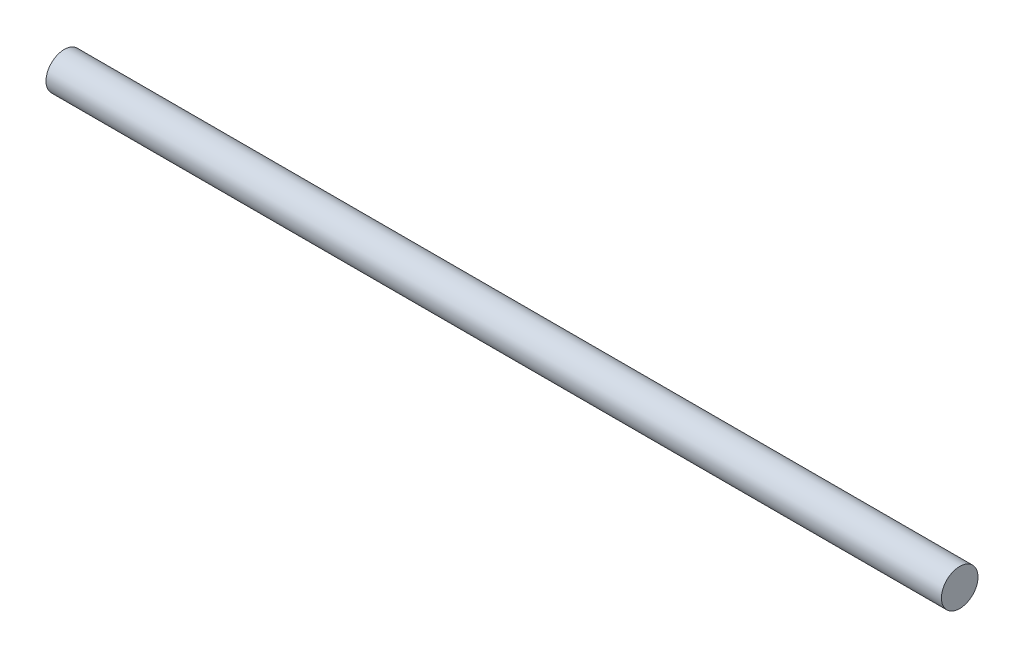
from build123d import *

# Parameters (mm, degrees)
ESQUISSE1_W = 97.872937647
ESQUISSE1_H = 2


with BuildPart() as part:
    # Esquisse1 → R_volution1 (revolve)
    with BuildSketch(Plane.XY):
        with Locations((71.98122632, -138)):
            Rectangle(ESQUISSE1_W, ESQUISSE1_H)
    revolve(axis=Axis((229.730472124, -139, 0), (-1, 0, 0)))


solid = part.part
